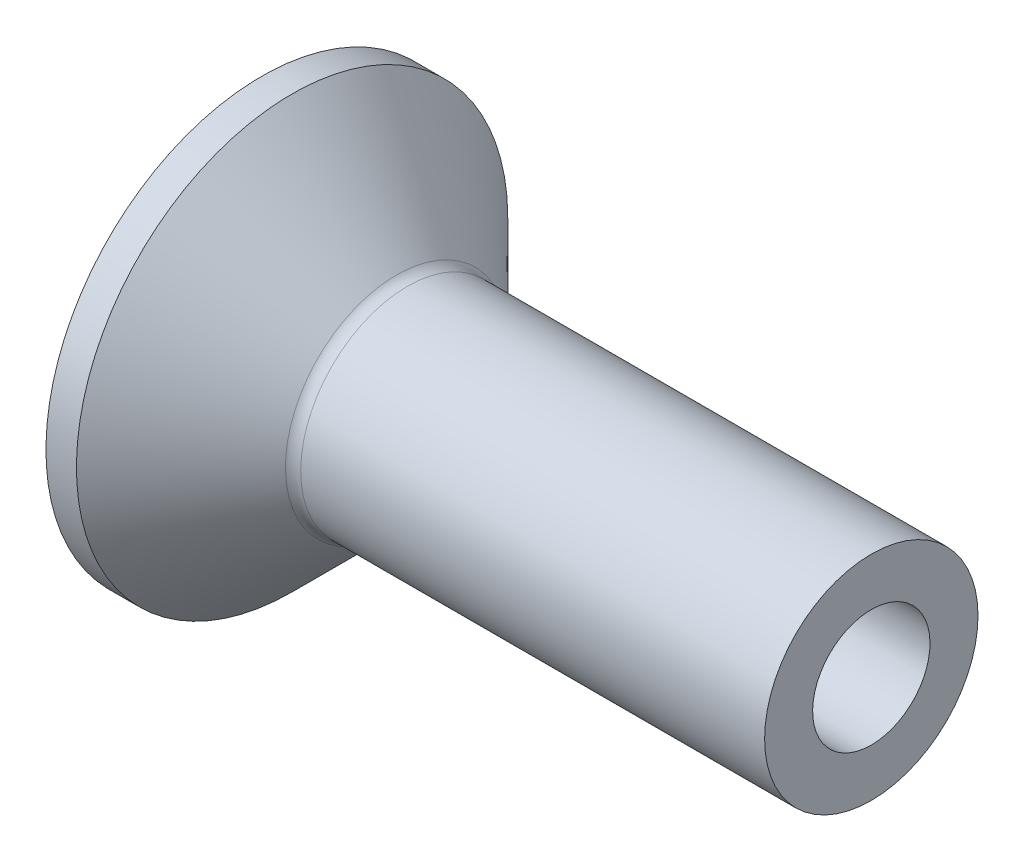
from build123d import *

# Parameters (mm, degrees)
FILLET1_R = 0.1


with BuildPart() as part:
    # Sketch1 → Base-Revolve (revolve)
    with BuildSketch(Plane(origin=(-0.2925, -1.7075, 0), x_dir=(0, 1, 0), z_dir=(0, 0, 1)), mode=Mode.PRIVATE) as base_revolve_sk:
        Polygon((1.7075, -0.2925), (3.1225, -0.2925), (3.1225, -0.4925), (2.4075, -1.2075), (2.4075, -4.2925), (1.7075, -4.2925), align=None)
    revolve(base_revolve_sk.sketch.rotate(Axis((-2.3225, 0, 0), (1, 0, 0)), 180), axis=Axis((-2.3225, 0, 0), (1, 0, 0)))

    # Fillet1
    fillet1_edges = [part.edges().sort_by_distance(p)[0] for p in [
        (0.915, 0.7, 0),
    ]]
    fillet(fillet1_edges, radius=FILLET1_R)

    # Sketch2 → Cut-Revolve1 (revolve, cut)
    with BuildSketch(Plane(origin=(-3.060649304, -3.445649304, 0), x_dir=(0, 1, 0), z_dir=(0, 0, 1)), mode=Mode.PRIVATE) as cut_revolve1_sk:
        Polygon((3.445649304, -5.620930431), (3.830649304, -5.900649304), (3.830649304, -7.060649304), (3.445649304, -7.060649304), align=None)
    revolve(cut_revolve1_sk.sketch.rotate(Axis((-1.185160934, 0, 0), (1, 0, 0)), 180), axis=Axis((-1.185160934, 0, 0), (1, 0, 0)), mode=Mode.SUBTRACT)


solid = part.part
